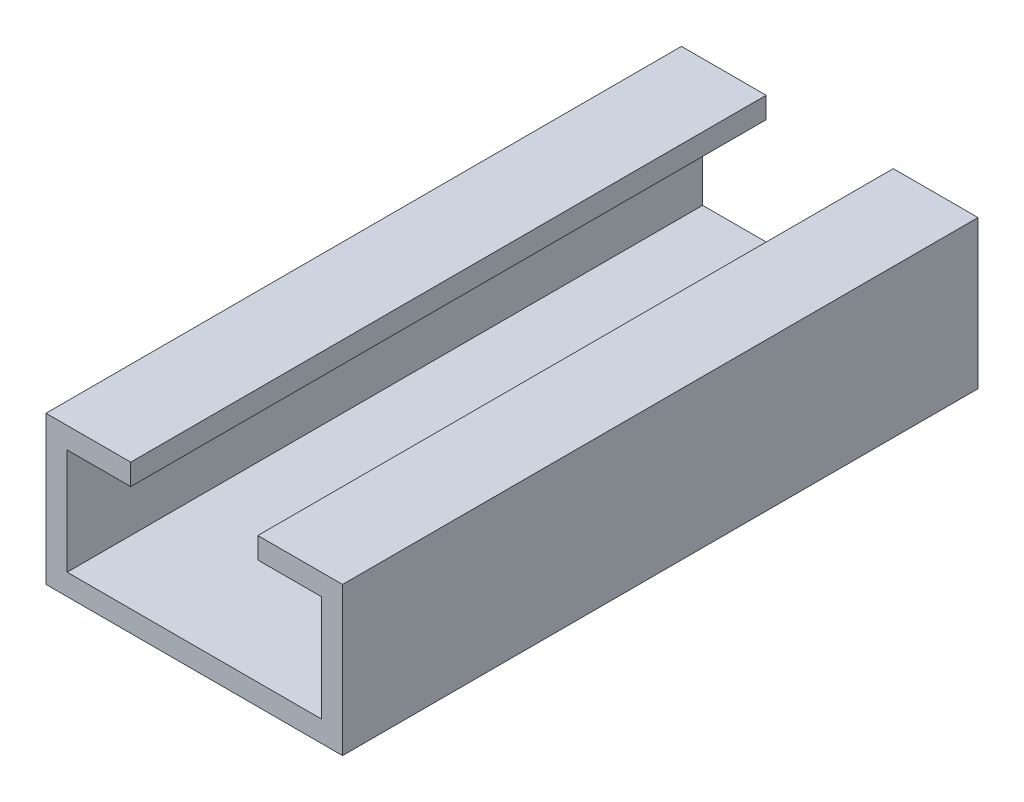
ISO-10303-21;
HEADER;
FILE_DESCRIPTION(('STEP AP214'),'2;1');
FILE_NAME('part.step','',(''),(''),'','','');
FILE_SCHEMA(('AUTOMOTIVE_DESIGN { 1 0 10303 214 1 1 1 1 }'));
ENDSEC;
DATA;
#1=APPLICATION_CONTEXT('core data for automotive mechanical design processes');
#2=APPLICATION_PROTOCOL_DEFINITION('international standard','automotive_design',2000,#1);
#3=PRODUCT_CONTEXT('',#1,'mechanical');
#4=PRODUCT('Part','Part','',(#3));
#5=PRODUCT_RELATED_PRODUCT_CATEGORY('part','',(#4));
#6=PRODUCT_DEFINITION_FORMATION('','',#4);
#7=PRODUCT_DEFINITION_CONTEXT('part definition',#1,'design');
#8=PRODUCT_DEFINITION('design','',#6,#7);
#9=PRODUCT_DEFINITION_SHAPE('','',#8);
#10=(LENGTH_UNIT() NAMED_UNIT(*) SI_UNIT(.MILLI.,.METRE.));
#11=(NAMED_UNIT(*) PLANE_ANGLE_UNIT() SI_UNIT($,.RADIAN.));
#12=(NAMED_UNIT(*) SI_UNIT($,.STERADIAN.) SOLID_ANGLE_UNIT());
#13=UNCERTAINTY_MEASURE_WITH_UNIT(LENGTH_MEASURE(1.E-05),#10,'distance_accuracy_value','');
#14=(GEOMETRIC_REPRESENTATION_CONTEXT(3) GLOBAL_UNCERTAINTY_ASSIGNED_CONTEXT((#13)) GLOBAL_UNIT_ASSIGNED_CONTEXT((#10,
#11,#12)) REPRESENTATION_CONTEXT('',''));
#15=CARTESIAN_POINT('',(0.,0.,0.));
#16=DIRECTION('',(0.,0.,1.));
#17=DIRECTION('',(1.,0.,0.));
#18=AXIS2_PLACEMENT_3D('',#15,#16,#17);
#19=CARTESIAN_POINT('',(-14.,0.,60.));
#20=DIRECTION('',(1.,0.,0.));
#21=DIRECTION('',(0.,0.,-1.));
#22=AXIS2_PLACEMENT_3D('',#19,#20,#21);
#23=PLANE('',#22);
#24=DIRECTION('',(0.,-1.,0.));
#25=VECTOR('',#24,1.);
#26=CARTESIAN_POINT('',(-14.,0.,0.));
#27=LINE('',#26,#25);
#28=CARTESIAN_POINT('',(-14.,14.,0.));
#29=VERTEX_POINT('',#28);
#30=CARTESIAN_POINT('',(-14.,0.,0.));
#31=VERTEX_POINT('',#30);
#32=EDGE_CURVE('E152',#29,#31,#27,.T.);
#33=ORIENTED_EDGE('',*,*,#32,.T.);
#34=DIRECTION('',(0.,0.,-1.));
#35=VECTOR('',#34,1.);
#36=CARTESIAN_POINT('',(-14.,0.,60.));
#37=LINE('',#36,#35);
#38=CARTESIAN_POINT('',(-14.,0.,60.));
#39=VERTEX_POINT('',#38);
#40=EDGE_CURVE('E11',#39,#31,#37,.T.);
#41=ORIENTED_EDGE('',*,*,#40,.F.);
#42=DIRECTION('',(0.,-1.,0.));
#43=VECTOR('',#42,1.);
#44=CARTESIAN_POINT('',(-14.,0.,60.));
#45=LINE('',#44,#43);
#46=CARTESIAN_POINT('',(-14.,14.,60.));
#47=VERTEX_POINT('',#46);
#48=EDGE_CURVE('E174',#47,#39,#45,.T.);
#49=ORIENTED_EDGE('',*,*,#48,.F.);
#50=DIRECTION('',(0.,0.,-1.));
#51=VECTOR('',#50,1.);
#52=CARTESIAN_POINT('',(-14.,14.,60.));
#53=LINE('',#52,#51);
#54=EDGE_CURVE('E148',#47,#29,#53,.T.);
#55=ORIENTED_EDGE('',*,*,#54,.T.);
#56=EDGE_LOOP('',(#33,#41,#49,#55));
#57=FACE_BOUND('',#56,.T.);
#58=ADVANCED_FACE('F32',(#57),#23,.F.);
#59=CARTESIAN_POINT('',(-14.,0.,60.));
#60=DIRECTION('',(0.,1.,0.));
#61=DIRECTION('',(0.,0.,1.));
#62=AXIS2_PLACEMENT_3D('',#59,#60,#61);
#63=PLANE('',#62);
#64=DIRECTION('',(1.,0.,0.));
#65=VECTOR('',#64,1.);
#66=CARTESIAN_POINT('',(-14.,0.,0.));
#67=LINE('',#66,#65);
#68=CARTESIAN_POINT('',(14.,0.,0.));
#69=VERTEX_POINT('',#68);
#70=EDGE_CURVE('E155',#31,#69,#67,.T.);
#71=ORIENTED_EDGE('',*,*,#70,.T.);
#72=DIRECTION('',(0.,0.,-1.));
#73=VECTOR('',#72,1.);
#74=CARTESIAN_POINT('',(14.,0.,60.));
#75=LINE('',#74,#73);
#76=CARTESIAN_POINT('',(14.,0.,60.));
#77=VERTEX_POINT('',#76);
#78=EDGE_CURVE('E40',#77,#69,#75,.T.);
#79=ORIENTED_EDGE('',*,*,#78,.F.);
#80=DIRECTION('',(1.,0.,0.));
#81=VECTOR('',#80,1.);
#82=CARTESIAN_POINT('',(-14.,0.,60.));
#83=LINE('',#82,#81);
#84=EDGE_CURVE('E103',#39,#77,#83,.T.);
#85=ORIENTED_EDGE('',*,*,#84,.F.);
#86=ORIENTED_EDGE('',*,*,#40,.T.);
#87=EDGE_LOOP('',(#71,#79,#85,#86));
#88=FACE_BOUND('',#87,.T.);
#89=ADVANCED_FACE('F252',(#88),#63,.F.);
#90=CARTESIAN_POINT('',(14.,0.,60.));
#91=DIRECTION('',(-1.,0.,0.));
#92=DIRECTION('',(0.,0.,1.));
#93=AXIS2_PLACEMENT_3D('',#90,#91,#92);
#94=PLANE('',#93);
#95=DIRECTION('',(0.,1.,0.));
#96=VECTOR('',#95,1.);
#97=CARTESIAN_POINT('',(14.,0.,0.));
#98=LINE('',#97,#96);
#99=CARTESIAN_POINT('',(14.,14.,0.));
#100=VERTEX_POINT('',#99);
#101=EDGE_CURVE('E157',#69,#100,#98,.T.);
#102=ORIENTED_EDGE('',*,*,#101,.T.);
#103=DIRECTION('',(0.,0.,-1.));
#104=VECTOR('',#103,1.);
#105=CARTESIAN_POINT('',(14.,14.,60.));
#106=LINE('',#105,#104);
#107=CARTESIAN_POINT('',(14.,14.,60.));
#108=VERTEX_POINT('',#107);
#109=EDGE_CURVE('E193',#108,#100,#106,.T.);
#110=ORIENTED_EDGE('',*,*,#109,.F.);
#111=DIRECTION('',(0.,1.,0.));
#112=VECTOR('',#111,1.);
#113=CARTESIAN_POINT('',(14.,0.,60.));
#114=LINE('',#113,#112);
#115=EDGE_CURVE('E201',#77,#108,#114,.T.);
#116=ORIENTED_EDGE('',*,*,#115,.F.);
#117=ORIENTED_EDGE('',*,*,#78,.T.);
#118=EDGE_LOOP('',(#102,#110,#116,#117));
#119=FACE_BOUND('',#118,.T.);
#120=ADVANCED_FACE('F199',(#119),#94,.F.);
#121=CARTESIAN_POINT('',(6.,14.,60.));
#122=DIRECTION('',(0.,-1.,0.));
#123=DIRECTION('',(0.,0.,-1.));
#124=AXIS2_PLACEMENT_3D('',#121,#122,#123);
#125=PLANE('',#124);
#126=DIRECTION('',(-1.,0.,0.));
#127=VECTOR('',#126,1.);
#128=CARTESIAN_POINT('',(6.,14.,0.));
#129=LINE('',#128,#127);
#130=CARTESIAN_POINT('',(6.,14.,0.));
#131=VERTEX_POINT('',#130);
#132=EDGE_CURVE('E159',#100,#131,#129,.T.);
#133=ORIENTED_EDGE('',*,*,#132,.T.);
#134=DIRECTION('',(0.,0.,-1.));
#135=VECTOR('',#134,1.);
#136=CARTESIAN_POINT('',(6.,14.,60.));
#137=LINE('',#136,#135);
#138=CARTESIAN_POINT('',(6.,14.,60.));
#139=VERTEX_POINT('',#138);
#140=EDGE_CURVE('E190',#139,#131,#137,.T.);
#141=ORIENTED_EDGE('',*,*,#140,.F.);
#142=DIRECTION('',(-1.,0.,0.));
#143=VECTOR('',#142,1.);
#144=CARTESIAN_POINT('',(6.,14.,60.));
#145=LINE('',#144,#143);
#146=EDGE_CURVE('E219',#108,#139,#145,.T.);
#147=ORIENTED_EDGE('',*,*,#146,.F.);
#148=ORIENTED_EDGE('',*,*,#109,.T.);
#149=EDGE_LOOP('',(#133,#141,#147,#148));
#150=FACE_BOUND('',#149,.T.);
#151=ADVANCED_FACE('F210',(#150),#125,.F.);
#152=CARTESIAN_POINT('',(6.,12.,60.));
#153=DIRECTION('',(1.,0.,0.));
#154=DIRECTION('',(0.,0.,-1.));
#155=AXIS2_PLACEMENT_3D('',#152,#153,#154);
#156=PLANE('',#155);
#157=DIRECTION('',(0.,-1.,0.));
#158=VECTOR('',#157,1.);
#159=CARTESIAN_POINT('',(6.,12.,0.));
#160=LINE('',#159,#158);
#161=CARTESIAN_POINT('',(6.,12.,0.));
#162=VERTEX_POINT('',#161);
#163=EDGE_CURVE('E161',#131,#162,#160,.T.);
#164=ORIENTED_EDGE('',*,*,#163,.T.);
#165=DIRECTION('',(0.,0.,-1.));
#166=VECTOR('',#165,1.);
#167=CARTESIAN_POINT('',(6.,12.,60.));
#168=LINE('',#167,#166);
#169=CARTESIAN_POINT('',(6.,12.,60.));
#170=VERTEX_POINT('',#169);
#171=EDGE_CURVE('E187',#170,#162,#168,.T.);
#172=ORIENTED_EDGE('',*,*,#171,.F.);
#173=DIRECTION('',(0.,-1.,0.));
#174=VECTOR('',#173,1.);
#175=CARTESIAN_POINT('',(6.,12.,60.));
#176=LINE('',#175,#174);
#177=EDGE_CURVE('E216',#139,#170,#176,.T.);
#178=ORIENTED_EDGE('',*,*,#177,.F.);
#179=ORIENTED_EDGE('',*,*,#140,.T.);
#180=EDGE_LOOP('',(#164,#172,#178,#179));
#181=FACE_BOUND('',#180,.T.);
#182=ADVANCED_FACE('F214',(#181),#156,.F.);
#183=CARTESIAN_POINT('',(6.,12.,60.));
#184=DIRECTION('',(0.,1.,0.));
#185=DIRECTION('',(0.,0.,1.));
#186=AXIS2_PLACEMENT_3D('',#183,#184,#185);
#187=PLANE('',#186);
#188=DIRECTION('',(1.,0.,0.));
#189=VECTOR('',#188,1.);
#190=CARTESIAN_POINT('',(6.,12.,0.));
#191=LINE('',#190,#189);
#192=CARTESIAN_POINT('',(12.,12.,0.));
#193=VERTEX_POINT('',#192);
#194=EDGE_CURVE('E163',#162,#193,#191,.T.);
#195=ORIENTED_EDGE('',*,*,#194,.T.);
#196=DIRECTION('',(0.,0.,-1.));
#197=VECTOR('',#196,1.);
#198=CARTESIAN_POINT('',(12.,12.,60.));
#199=LINE('',#198,#197);
#200=CARTESIAN_POINT('',(12.,12.,60.));
#201=VERTEX_POINT('',#200);
#202=EDGE_CURVE('E184',#201,#193,#199,.T.);
#203=ORIENTED_EDGE('',*,*,#202,.F.);
#204=DIRECTION('',(1.,0.,0.));
#205=VECTOR('',#204,1.);
#206=CARTESIAN_POINT('',(6.,12.,60.));
#207=LINE('',#206,#205);
#208=EDGE_CURVE('E218',#170,#201,#207,.T.);
#209=ORIENTED_EDGE('',*,*,#208,.F.);
#210=ORIENTED_EDGE('',*,*,#171,.T.);
#211=EDGE_LOOP('',(#195,#203,#209,#210));
#212=FACE_BOUND('',#211,.T.);
#213=ADVANCED_FACE('F265',(#212),#187,.F.);
#214=CARTESIAN_POINT('',(12.,2.,60.));
#215=DIRECTION('',(1.,0.,0.));
#216=DIRECTION('',(0.,1.,0.));
#217=AXIS2_PLACEMENT_3D('',#214,#215,#216);
#218=PLANE('',#217);
#219=DIRECTION('',(0.,-1.,0.));
#220=VECTOR('',#219,1.);
#221=CARTESIAN_POINT('',(12.,2.,0.));
#222=LINE('',#221,#220);
#223=CARTESIAN_POINT('',(12.,2.,0.));
#224=VERTEX_POINT('',#223);
#225=EDGE_CURVE('E165',#193,#224,#222,.T.);
#226=ORIENTED_EDGE('',*,*,#225,.T.);
#227=DIRECTION('',(0.,0.,-1.));
#228=VECTOR('',#227,1.);
#229=CARTESIAN_POINT('',(12.,2.,60.));
#230=LINE('',#229,#228);
#231=CARTESIAN_POINT('',(12.,2.,60.));
#232=VERTEX_POINT('',#231);
#233=EDGE_CURVE('E181',#232,#224,#230,.T.);
#234=ORIENTED_EDGE('',*,*,#233,.F.);
#235=DIRECTION('',(0.,-1.,0.));
#236=VECTOR('',#235,1.);
#237=CARTESIAN_POINT('',(12.,2.,60.));
#238=LINE('',#237,#236);
#239=EDGE_CURVE('E221',#201,#232,#238,.T.);
#240=ORIENTED_EDGE('',*,*,#239,.F.);
#241=ORIENTED_EDGE('',*,*,#202,.T.);
#242=EDGE_LOOP('',(#226,#234,#240,#241));
#243=FACE_BOUND('',#242,.T.);
#244=ADVANCED_FACE('F268',(#243),#218,.F.);
#245=CARTESIAN_POINT('',(-12.,2.,60.));
#246=DIRECTION('',(0.,-1.,0.));
#247=DIRECTION('',(0.,0.,-1.));
#248=AXIS2_PLACEMENT_3D('',#245,#246,#247);
#249=PLANE('',#248);
#250=DIRECTION('',(-1.,0.,0.));
#251=VECTOR('',#250,1.);
#252=CARTESIAN_POINT('',(-12.,2.,0.));
#253=LINE('',#252,#251);
#254=CARTESIAN_POINT('',(-12.,2.,0.));
#255=VERTEX_POINT('',#254);
#256=EDGE_CURVE('E167',#224,#255,#253,.T.);
#257=ORIENTED_EDGE('',*,*,#256,.T.);
#258=DIRECTION('',(0.,0.,-1.));
#259=VECTOR('',#258,1.);
#260=CARTESIAN_POINT('',(-12.,2.,60.));
#261=LINE('',#260,#259);
#262=CARTESIAN_POINT('',(-12.,2.,60.));
#263=VERTEX_POINT('',#262);
#264=EDGE_CURVE('E178',#263,#255,#261,.T.);
#265=ORIENTED_EDGE('',*,*,#264,.F.);
#266=DIRECTION('',(-1.,0.,0.));
#267=VECTOR('',#266,1.);
#268=CARTESIAN_POINT('',(-12.,2.,60.));
#269=LINE('',#268,#267);
#270=EDGE_CURVE('E227',#232,#263,#269,.T.);
#271=ORIENTED_EDGE('',*,*,#270,.F.);
#272=ORIENTED_EDGE('',*,*,#233,.T.);
#273=EDGE_LOOP('',(#257,#265,#271,#272));
#274=FACE_BOUND('',#273,.T.);
#275=ADVANCED_FACE('F233',(#274),#249,.F.);
#276=CARTESIAN_POINT('',(-12.,2.,60.));
#277=DIRECTION('',(-1.,0.,0.));
#278=DIRECTION('',(0.,0.,1.));
#279=AXIS2_PLACEMENT_3D('',#276,#277,#278);
#280=PLANE('',#279);
#281=DIRECTION('',(0.,1.,0.));
#282=VECTOR('',#281,1.);
#283=CARTESIAN_POINT('',(-12.,2.,0.));
#284=LINE('',#283,#282);
#285=CARTESIAN_POINT('',(-12.,12.,0.));
#286=VERTEX_POINT('',#285);
#287=EDGE_CURVE('E169',#255,#286,#284,.T.);
#288=ORIENTED_EDGE('',*,*,#287,.T.);
#289=DIRECTION('',(0.,0.,-1.));
#290=VECTOR('',#289,1.);
#291=CARTESIAN_POINT('',(-12.,12.,60.));
#292=LINE('',#291,#290);
#293=CARTESIAN_POINT('',(-12.,12.,60.));
#294=VERTEX_POINT('',#293);
#295=EDGE_CURVE('E143',#294,#286,#292,.T.);
#296=ORIENTED_EDGE('',*,*,#295,.F.);
#297=DIRECTION('',(0.,1.,0.));
#298=VECTOR('',#297,1.);
#299=CARTESIAN_POINT('',(-12.,2.,60.));
#300=LINE('',#299,#298);
#301=EDGE_CURVE('E134',#263,#294,#300,.T.);
#302=ORIENTED_EDGE('',*,*,#301,.F.);
#303=ORIENTED_EDGE('',*,*,#264,.T.);
#304=EDGE_LOOP('',(#288,#296,#302,#303));
#305=FACE_BOUND('',#304,.T.);
#306=ADVANCED_FACE('F237',(#305),#280,.F.);
#307=CARTESIAN_POINT('',(-12.,12.,60.));
#308=DIRECTION('',(0.,1.,0.));
#309=DIRECTION('',(0.,0.,1.));
#310=AXIS2_PLACEMENT_3D('',#307,#308,#309);
#311=PLANE('',#310);
#312=DIRECTION('',(1.,0.,0.));
#313=VECTOR('',#312,1.);
#314=CARTESIAN_POINT('',(-12.,12.,0.));
#315=LINE('',#314,#313);
#316=CARTESIAN_POINT('',(-6.,12.,0.));
#317=VERTEX_POINT('',#316);
#318=EDGE_CURVE('E142',#286,#317,#315,.T.);
#319=ORIENTED_EDGE('',*,*,#318,.T.);
#320=DIRECTION('',(0.,0.,-1.));
#321=VECTOR('',#320,1.);
#322=CARTESIAN_POINT('',(-6.,12.,60.));
#323=LINE('',#322,#321);
#324=CARTESIAN_POINT('',(-6.,12.,60.));
#325=VERTEX_POINT('',#324);
#326=EDGE_CURVE('E139',#325,#317,#323,.T.);
#327=ORIENTED_EDGE('',*,*,#326,.F.);
#328=DIRECTION('',(1.,0.,0.));
#329=VECTOR('',#328,1.);
#330=CARTESIAN_POINT('',(-12.,12.,60.));
#331=LINE('',#330,#329);
#332=EDGE_CURVE('E128',#294,#325,#331,.T.);
#333=ORIENTED_EDGE('',*,*,#332,.F.);
#334=ORIENTED_EDGE('',*,*,#295,.T.);
#335=EDGE_LOOP('',(#319,#327,#333,#334));
#336=FACE_BOUND('',#335,.T.);
#337=ADVANCED_FACE('F140',(#336),#311,.F.);
#338=CARTESIAN_POINT('',(-6.,14.,60.));
#339=DIRECTION('',(-1.,0.,0.));
#340=DIRECTION('',(0.,-1.,0.));
#341=AXIS2_PLACEMENT_3D('',#338,#339,#340);
#342=PLANE('',#341);
#343=DIRECTION('',(0.,1.,0.));
#344=VECTOR('',#343,1.);
#345=CARTESIAN_POINT('',(-6.,14.,0.));
#346=LINE('',#345,#344);
#347=CARTESIAN_POINT('',(-6.,14.,0.));
#348=VERTEX_POINT('',#347);
#349=EDGE_CURVE('E89',#317,#348,#346,.T.);
#350=ORIENTED_EDGE('',*,*,#349,.T.);
#351=DIRECTION('',(0.,0.,-1.));
#352=VECTOR('',#351,1.);
#353=CARTESIAN_POINT('',(-6.,14.,60.));
#354=LINE('',#353,#352);
#355=CARTESIAN_POINT('',(-6.,14.,60.));
#356=VERTEX_POINT('',#355);
#357=EDGE_CURVE('E144',#356,#348,#354,.T.);
#358=ORIENTED_EDGE('',*,*,#357,.F.);
#359=DIRECTION('',(0.,1.,0.));
#360=VECTOR('',#359,1.);
#361=CARTESIAN_POINT('',(-6.,14.,60.));
#362=LINE('',#361,#360);
#363=EDGE_CURVE('E132',#325,#356,#362,.T.);
#364=ORIENTED_EDGE('',*,*,#363,.F.);
#365=ORIENTED_EDGE('',*,*,#326,.T.);
#366=EDGE_LOOP('',(#350,#358,#364,#365));
#367=FACE_BOUND('',#366,.T.);
#368=ADVANCED_FACE('F146',(#367),#342,.F.);
#369=CARTESIAN_POINT('',(-14.,14.,60.));
#370=DIRECTION('',(0.,-1.,0.));
#371=DIRECTION('',(0.,0.,-1.));
#372=AXIS2_PLACEMENT_3D('',#369,#370,#371);
#373=PLANE('',#372);
#374=DIRECTION('',(-1.,0.,0.));
#375=VECTOR('',#374,1.);
#376=CARTESIAN_POINT('',(-14.,14.,0.));
#377=LINE('',#376,#375);
#378=EDGE_CURVE('E95',#348,#29,#377,.T.);
#379=ORIENTED_EDGE('',*,*,#378,.T.);
#380=ORIENTED_EDGE('',*,*,#54,.F.);
#381=DIRECTION('',(-1.,0.,0.));
#382=VECTOR('',#381,1.);
#383=CARTESIAN_POINT('',(-14.,14.,60.));
#384=LINE('',#383,#382);
#385=EDGE_CURVE('E48',#356,#47,#384,.T.);
#386=ORIENTED_EDGE('',*,*,#385,.F.);
#387=ORIENTED_EDGE('',*,*,#357,.T.);
#388=EDGE_LOOP('',(#379,#380,#386,#387));
#389=FACE_BOUND('',#388,.T.);
#390=ADVANCED_FACE('F241',(#389),#373,.F.);
#391=CARTESIAN_POINT('',(-14.,14.,60.));
#392=DIRECTION('',(0.,0.,-1.));
#393=DIRECTION('',(-1.,0.,0.));
#394=AXIS2_PLACEMENT_3D('',#391,#392,#393);
#395=PLANE('',#394);
#396=ORIENTED_EDGE('',*,*,#48,.T.);
#397=ORIENTED_EDGE('',*,*,#84,.T.);
#398=ORIENTED_EDGE('',*,*,#115,.T.);
#399=ORIENTED_EDGE('',*,*,#146,.T.);
#400=ORIENTED_EDGE('',*,*,#177,.T.);
#401=ORIENTED_EDGE('',*,*,#208,.T.);
#402=ORIENTED_EDGE('',*,*,#239,.T.);
#403=ORIENTED_EDGE('',*,*,#270,.T.);
#404=ORIENTED_EDGE('',*,*,#301,.T.);
#405=ORIENTED_EDGE('',*,*,#332,.T.);
#406=ORIENTED_EDGE('',*,*,#363,.T.);
#407=ORIENTED_EDGE('',*,*,#385,.T.);
#408=EDGE_LOOP('',(#396,#397,#398,#399,#400,#401,#402,#403,#404,#405,#406,#407));
#409=FACE_BOUND('',#408,.T.);
#410=ADVANCED_FACE('F130',(#409),#395,.F.);
#411=CARTESIAN_POINT('',(-14.,14.,0.));
#412=DIRECTION('',(0.,0.,-1.));
#413=DIRECTION('',(-1.,0.,0.));
#414=AXIS2_PLACEMENT_3D('',#411,#412,#413);
#415=PLANE('',#414);
#416=ORIENTED_EDGE('',*,*,#32,.F.);
#417=ORIENTED_EDGE('',*,*,#378,.F.);
#418=ORIENTED_EDGE('',*,*,#349,.F.);
#419=ORIENTED_EDGE('',*,*,#318,.F.);
#420=ORIENTED_EDGE('',*,*,#287,.F.);
#421=ORIENTED_EDGE('',*,*,#256,.F.);
#422=ORIENTED_EDGE('',*,*,#225,.F.);
#423=ORIENTED_EDGE('',*,*,#194,.F.);
#424=ORIENTED_EDGE('',*,*,#163,.F.);
#425=ORIENTED_EDGE('',*,*,#132,.F.);
#426=ORIENTED_EDGE('',*,*,#101,.F.);
#427=ORIENTED_EDGE('',*,*,#70,.F.);
#428=EDGE_LOOP('',(#416,#417,#418,#419,#420,#421,#422,#423,#424,#425,#426,#427));
#429=FACE_BOUND('',#428,.T.);
#430=ADVANCED_FACE('F205',(#429),#415,.T.);
#431=CLOSED_SHELL('',(#58,#89,#120,#151,#182,#213,#244,#275,#306,#337,#368,#390,#410,#430));
#432=MANIFOLD_SOLID_BREP('B2',#431);
#433=ADVANCED_BREP_SHAPE_REPRESENTATION('',(#18,#432),#14);
#434=SHAPE_DEFINITION_REPRESENTATION(#9,#433);
ENDSEC;
END-ISO-10303-21;
